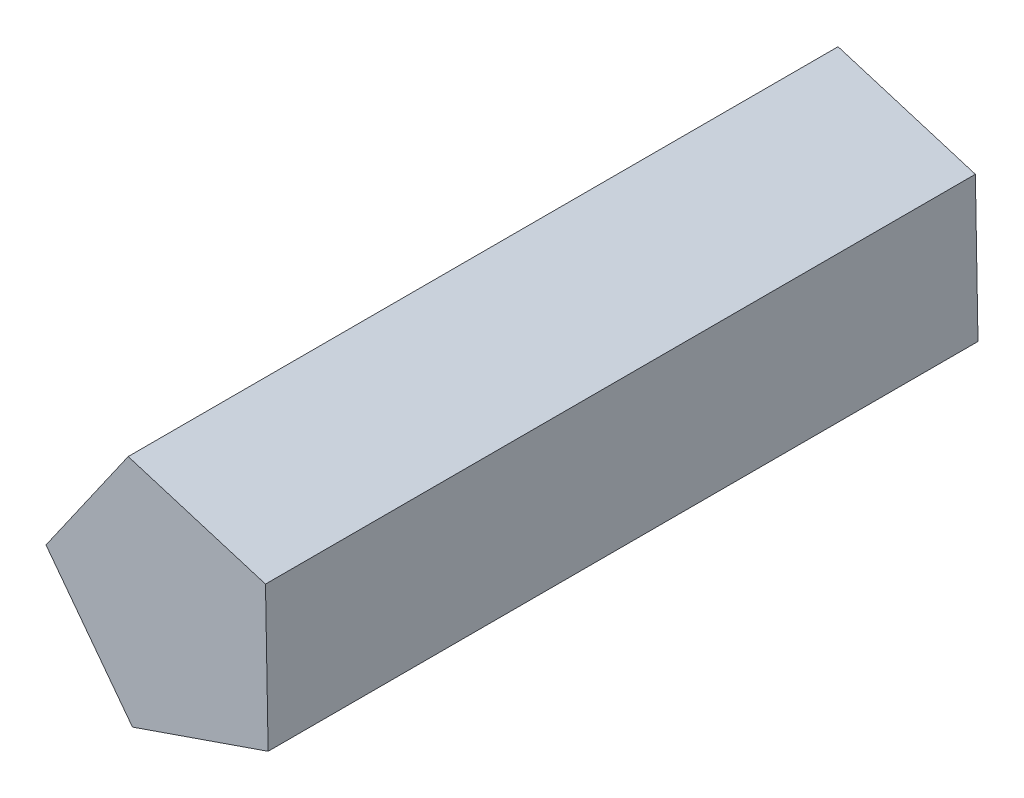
from build123d import *

# Parameters (mm, degrees)
BOSS_EXTRUDE1_DEPTH = 24
SCALE1_SCALE_X      = 1.571428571
SCALE1_SCALE_Y      = 1.571428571
SCALE1_SCALE_Z      = 1


with BuildPart() as part:
    # Sketch1 → Boss-Extrude1 (new body)
    with BuildSketch(Plane.XY):
        Polygon((14.053946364, 2.254292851), (13.997085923, 5.341575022), (11.043335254, 6.241520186), (9.274677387, 3.710434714), (11.13533738, 1.2461927), align=None)
    extrude(amount=BOSS_EXTRUDE1_DEPTH)


with BuildPart() as part_1:
    # Scale1: scaled about (11.900876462, 3.758803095, 12)
    add(part.part.scale((SCALE1_SCALE_X, SCALE1_SCALE_Y, SCALE1_SCALE_Z), about=(11.900876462, 3.758803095, 12)))


solid = part_1.part
